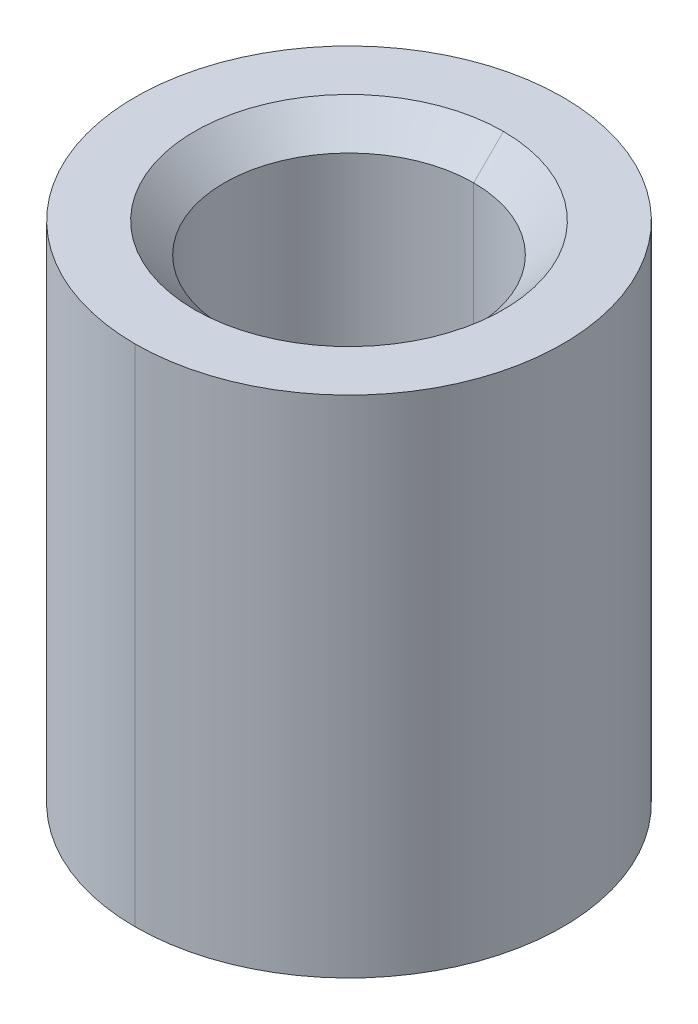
ISO-10303-21;
HEADER;
FILE_DESCRIPTION(('STEP AP214'),'2;1');
FILE_NAME('part.step','',(''),(''),'','','');
FILE_SCHEMA(('AUTOMOTIVE_DESIGN { 1 0 10303 214 1 1 1 1 }'));
ENDSEC;
DATA;
#1=APPLICATION_CONTEXT('core data for automotive mechanical design processes');
#2=APPLICATION_PROTOCOL_DEFINITION('international standard','automotive_design',2000,#1);
#3=PRODUCT_CONTEXT('',#1,'mechanical');
#4=PRODUCT('Part','Part','',(#3));
#5=PRODUCT_RELATED_PRODUCT_CATEGORY('part','',(#4));
#6=PRODUCT_DEFINITION_FORMATION('','',#4);
#7=PRODUCT_DEFINITION_CONTEXT('part definition',#1,'design');
#8=PRODUCT_DEFINITION('design','',#6,#7);
#9=PRODUCT_DEFINITION_SHAPE('','',#8);
#10=(LENGTH_UNIT() NAMED_UNIT(*) SI_UNIT(.MILLI.,.METRE.));
#11=(NAMED_UNIT(*) PLANE_ANGLE_UNIT() SI_UNIT($,.RADIAN.));
#12=(NAMED_UNIT(*) SI_UNIT($,.STERADIAN.) SOLID_ANGLE_UNIT());
#13=UNCERTAINTY_MEASURE_WITH_UNIT(LENGTH_MEASURE(1.E-05),#10,'distance_accuracy_value','');
#14=(GEOMETRIC_REPRESENTATION_CONTEXT(3) GLOBAL_UNCERTAINTY_ASSIGNED_CONTEXT((#13)) GLOBAL_UNIT_ASSIGNED_CONTEXT((#10,
#11,#12)) REPRESENTATION_CONTEXT('',''));
#15=CARTESIAN_POINT('',(0.,0.,0.));
#16=DIRECTION('',(0.,0.,1.));
#17=DIRECTION('',(1.,0.,0.));
#18=AXIS2_PLACEMENT_3D('',#15,#16,#17);
#19=CARTESIAN_POINT('',(-45.,9.7,-73.8));
#20=DIRECTION('',(0.,1.,0.));
#21=DIRECTION('',(0.,0.,-1.));
#22=AXIS2_PLACEMENT_3D('',#19,#20,#21);
#23=CONICAL_SURFACE('',#22,2.6,0.785398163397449);
#24=DIRECTION('',(0.,0.707106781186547,0.707106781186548));
#25=VECTOR('',#24,1.);
#26=CARTESIAN_POINT('',(-45.,9.7,-71.2));
#27=LINE('',#26,#25);
#28=CARTESIAN_POINT('',(-45.,9.2,-71.7));
#29=VERTEX_POINT('',#28);
#30=CARTESIAN_POINT('',(-45.,9.7,-71.2));
#31=VERTEX_POINT('',#30);
#32=EDGE_CURVE('E99',#29,#31,#27,.T.);
#33=ORIENTED_EDGE('',*,*,#32,.F.);
#34=CARTESIAN_POINT('',(-45.,9.2,-73.8));
#35=DIRECTION('',(0.,1.,0.));
#36=DIRECTION('',(0.,0.,-1.));
#37=AXIS2_PLACEMENT_3D('',#34,#35,#36);
#38=CIRCLE('',#37,2.1);
#39=CARTESIAN_POINT('',(-45.,9.2,-75.9));
#40=VERTEX_POINT('',#39);
#41=EDGE_CURVE('E11',#40,#29,#38,.T.);
#42=ORIENTED_EDGE('',*,*,#41,.F.);
#43=DIRECTION('',(0.,0.707106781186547,-0.707106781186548));
#44=VECTOR('',#43,1.);
#45=CARTESIAN_POINT('',(-45.,9.7,-76.4));
#46=LINE('',#45,#44);
#47=CARTESIAN_POINT('',(-45.,9.7,-76.4));
#48=VERTEX_POINT('',#47);
#49=EDGE_CURVE('E108',#40,#48,#46,.T.);
#50=ORIENTED_EDGE('',*,*,#49,.T.);
#51=CARTESIAN_POINT('',(-45.,9.7,-73.8));
#52=DIRECTION('',(0.,1.,0.));
#53=DIRECTION('',(0.,0.,-1.));
#54=AXIS2_PLACEMENT_3D('',#51,#52,#53);
#55=CIRCLE('',#54,2.6);
#56=EDGE_CURVE('E100',#48,#31,#55,.T.);
#57=ORIENTED_EDGE('',*,*,#56,.T.);
#58=EDGE_LOOP('',(#33,#42,#50,#57));
#59=FACE_BOUND('',#58,.T.);
#60=ADVANCED_FACE('F16',(#59),#23,.F.);
#61=CARTESIAN_POINT('',(-45.,9.7,-73.8));
#62=DIRECTION('',(0.,1.,0.));
#63=DIRECTION('',(0.,0.,-1.));
#64=AXIS2_PLACEMENT_3D('',#61,#62,#63);
#65=CYLINDRICAL_SURFACE('',#64,2.1);
#66=DIRECTION('',(0.,1.,0.));
#67=VECTOR('',#66,1.);
#68=CARTESIAN_POINT('',(-45.,9.7,-71.7));
#69=LINE('',#68,#67);
#70=CARTESIAN_POINT('',(-45.,2.2,-71.7));
#71=VERTEX_POINT('',#70);
#72=EDGE_CURVE('E81',#71,#29,#69,.T.);
#73=ORIENTED_EDGE('',*,*,#72,.F.);
#74=CARTESIAN_POINT('',(-45.,2.2,-73.8));
#75=DIRECTION('',(0.,1.,0.));
#76=DIRECTION('',(0.,0.,-1.));
#77=AXIS2_PLACEMENT_3D('',#74,#75,#76);
#78=CIRCLE('',#77,2.1);
#79=CARTESIAN_POINT('',(-45.,2.2,-75.9));
#80=VERTEX_POINT('',#79);
#81=EDGE_CURVE('E25',#80,#71,#78,.T.);
#82=ORIENTED_EDGE('',*,*,#81,.F.);
#83=DIRECTION('',(0.,1.,0.));
#84=VECTOR('',#83,1.);
#85=CARTESIAN_POINT('',(-45.,9.7,-75.9));
#86=LINE('',#85,#84);
#87=EDGE_CURVE('E84',#80,#40,#86,.T.);
#88=ORIENTED_EDGE('',*,*,#87,.T.);
#89=ORIENTED_EDGE('',*,*,#41,.T.);
#90=EDGE_LOOP('',(#73,#82,#88,#89));
#91=FACE_BOUND('',#90,.T.);
#92=ADVANCED_FACE('F80',(#91),#65,.F.);
#93=CARTESIAN_POINT('',(-45.,2.2,-73.8));
#94=DIRECTION('',(0.,1.,0.));
#95=DIRECTION('',(0.,0.,-1.));
#96=AXIS2_PLACEMENT_3D('',#93,#94,#95);
#97=CONICAL_SURFACE('',#96,2.1,1.32644576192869);
#98=DIRECTION('',(0.,0.241926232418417,0.970294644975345));
#99=VECTOR('',#98,1.);
#100=CARTESIAN_POINT('',(-45.,2.2,-71.7));
#101=LINE('',#100,#99);
#102=CARTESIAN_POINT('',(-45.,1.67640122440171,-73.8));
#103=VERTEX_POINT('',#102);
#104=EDGE_CURVE('E121',#103,#71,#101,.T.);
#105=ORIENTED_EDGE('',*,*,#104,.F.);
#106=DIRECTION('',(0.,0.241926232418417,-0.970294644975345));
#107=VECTOR('',#106,1.);
#108=CARTESIAN_POINT('',(-45.,2.2,-75.9));
#109=LINE('',#108,#107);
#110=EDGE_CURVE('E134',#103,#80,#109,.T.);
#111=ORIENTED_EDGE('',*,*,#110,.T.);
#112=ORIENTED_EDGE('',*,*,#81,.T.);
#113=EDGE_LOOP('',(#105,#111,#112));
#114=FACE_BOUND('',#113,.T.);
#115=ADVANCED_FACE('F152',(#114),#97,.F.);
#116=CARTESIAN_POINT('',(-45.,9.7,-73.8));
#117=DIRECTION('',(0.,-1.,0.));
#118=DIRECTION('',(-1.,0.,0.));
#119=AXIS2_PLACEMENT_3D('',#116,#117,#118);
#120=PLANE('',#119);
#121=ORIENTED_EDGE('',*,*,#56,.F.);
#122=CARTESIAN_POINT('',(-45.,9.7,-73.8));
#123=DIRECTION('',(0.,1.,0.));
#124=DIRECTION('',(0.,0.,-1.));
#125=AXIS2_PLACEMENT_3D('',#122,#123,#124);
#126=CIRCLE('',#125,2.6);
#127=EDGE_CURVE('E105',#31,#48,#126,.T.);
#128=ORIENTED_EDGE('',*,*,#127,.F.);
#129=EDGE_LOOP('',(#121,#128));
#130=FACE_BOUND('',#129,.T.);
#131=CARTESIAN_POINT('',(-45.,9.7,-73.8));
#132=DIRECTION('',(0.,1.,0.));
#133=DIRECTION('',(0.,0.,-1.));
#134=AXIS2_PLACEMENT_3D('',#131,#132,#133);
#135=CIRCLE('',#134,3.6);
#136=CARTESIAN_POINT('',(-45.,9.7,-77.4));
#137=VERTEX_POINT('',#136);
#138=CARTESIAN_POINT('',(-45.,9.7,-70.2));
#139=VERTEX_POINT('',#138);
#140=EDGE_CURVE('E114',#137,#139,#135,.T.);
#141=ORIENTED_EDGE('',*,*,#140,.T.);
#142=CARTESIAN_POINT('',(-45.,9.7,-73.8));
#143=DIRECTION('',(0.,1.,0.));
#144=DIRECTION('',(0.,0.,-1.));
#145=AXIS2_PLACEMENT_3D('',#142,#143,#144);
#146=CIRCLE('',#145,3.6);
#147=EDGE_CURVE('E35',#139,#137,#146,.T.);
#148=ORIENTED_EDGE('',*,*,#147,.T.);
#149=EDGE_LOOP('',(#141,#148));
#150=FACE_BOUND('',#149,.T.);
#151=ADVANCED_FACE('F18',(#130,#150),#120,.F.);
#152=CARTESIAN_POINT('',(-48.6,1.2,-73.8));
#153=DIRECTION('',(0.,1.,0.));
#154=DIRECTION('',(0.,0.,-1.));
#155=AXIS2_PLACEMENT_3D('',#152,#153,#154);
#156=PLANE('',#155);
#157=CARTESIAN_POINT('',(-45.,1.2,-73.8));
#158=DIRECTION('',(0.,1.,0.));
#159=DIRECTION('',(0.,0.,-1.));
#160=AXIS2_PLACEMENT_3D('',#157,#158,#159);
#161=CIRCLE('',#160,3.6);
#162=CARTESIAN_POINT('',(-45.,1.2,-77.4));
#163=VERTEX_POINT('',#162);
#164=CARTESIAN_POINT('',(-45.,1.2,-70.2));
#165=VERTEX_POINT('',#164);
#166=EDGE_CURVE('E116',#163,#165,#161,.T.);
#167=ORIENTED_EDGE('',*,*,#166,.F.);
#168=CARTESIAN_POINT('',(-45.,1.2,-73.8));
#169=DIRECTION('',(0.,1.,0.));
#170=DIRECTION('',(0.,0.,-1.));
#171=AXIS2_PLACEMENT_3D('',#168,#169,#170);
#172=CIRCLE('',#171,3.6);
#173=EDGE_CURVE('E128',#165,#163,#172,.T.);
#174=ORIENTED_EDGE('',*,*,#173,.F.);
#175=EDGE_LOOP('',(#167,#174));
#176=FACE_BOUND('',#175,.T.);
#177=ADVANCED_FACE('F175',(#176),#156,.F.);
#178=CARTESIAN_POINT('',(-45.,9.7,-73.8));
#179=DIRECTION('',(0.,1.,0.));
#180=DIRECTION('',(0.,0.,-1.));
#181=AXIS2_PLACEMENT_3D('',#178,#179,#180);
#182=CYLINDRICAL_SURFACE('',#181,3.6);
#183=DIRECTION('',(0.,1.,0.));
#184=VECTOR('',#183,1.);
#185=CARTESIAN_POINT('',(-45.,9.7,-70.2));
#186=LINE('',#185,#184);
#187=EDGE_CURVE('E120',#165,#139,#186,.T.);
#188=ORIENTED_EDGE('',*,*,#187,.F.);
#189=ORIENTED_EDGE('',*,*,#173,.T.);
#190=DIRECTION('',(0.,1.,0.));
#191=VECTOR('',#190,1.);
#192=CARTESIAN_POINT('',(-45.,9.7,-77.4));
#193=LINE('',#192,#191);
#194=EDGE_CURVE('E131',#163,#137,#193,.T.);
#195=ORIENTED_EDGE('',*,*,#194,.T.);
#196=ORIENTED_EDGE('',*,*,#147,.F.);
#197=EDGE_LOOP('',(#188,#189,#195,#196));
#198=FACE_BOUND('',#197,.T.);
#199=ADVANCED_FACE('F165',(#198),#182,.T.);
#200=CARTESIAN_POINT('',(-45.,9.7,-73.8));
#201=DIRECTION('',(0.,1.,0.));
#202=DIRECTION('',(0.,0.,-1.));
#203=AXIS2_PLACEMENT_3D('',#200,#201,#202);
#204=CYLINDRICAL_SURFACE('',#203,3.6);
#205=ORIENTED_EDGE('',*,*,#166,.T.);
#206=ORIENTED_EDGE('',*,*,#187,.T.);
#207=ORIENTED_EDGE('',*,*,#140,.F.);
#208=ORIENTED_EDGE('',*,*,#194,.F.);
#209=EDGE_LOOP('',(#205,#206,#207,#208));
#210=FACE_BOUND('',#209,.T.);
#211=ADVANCED_FACE('F157',(#210),#204,.T.);
#212=CARTESIAN_POINT('',(-45.,2.2,-73.8));
#213=DIRECTION('',(0.,1.,0.));
#214=DIRECTION('',(0.,0.,-1.));
#215=AXIS2_PLACEMENT_3D('',#212,#213,#214);
#216=CONICAL_SURFACE('',#215,2.1,1.32644576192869);
#217=ORIENTED_EDGE('',*,*,#110,.F.);
#218=ORIENTED_EDGE('',*,*,#104,.T.);
#219=CARTESIAN_POINT('',(-45.,2.2,-73.8));
#220=DIRECTION('',(0.,1.,0.));
#221=DIRECTION('',(0.,0.,-1.));
#222=AXIS2_PLACEMENT_3D('',#219,#220,#221);
#223=CIRCLE('',#222,2.1);
#224=EDGE_CURVE('E95',#71,#80,#223,.T.);
#225=ORIENTED_EDGE('',*,*,#224,.T.);
#226=EDGE_LOOP('',(#217,#218,#225));
#227=FACE_BOUND('',#226,.T.);
#228=ADVANCED_FACE('F155',(#227),#216,.F.);
#229=CARTESIAN_POINT('',(-45.,9.7,-73.8));
#230=DIRECTION('',(0.,1.,0.));
#231=DIRECTION('',(0.,0.,-1.));
#232=AXIS2_PLACEMENT_3D('',#229,#230,#231);
#233=CYLINDRICAL_SURFACE('',#232,2.1);
#234=ORIENTED_EDGE('',*,*,#224,.F.);
#235=ORIENTED_EDGE('',*,*,#72,.T.);
#236=CARTESIAN_POINT('',(-45.,9.2,-73.8));
#237=DIRECTION('',(0.,1.,0.));
#238=DIRECTION('',(0.,0.,-1.));
#239=AXIS2_PLACEMENT_3D('',#236,#237,#238);
#240=CIRCLE('',#239,2.1);
#241=EDGE_CURVE('E93',#29,#40,#240,.T.);
#242=ORIENTED_EDGE('',*,*,#241,.T.);
#243=ORIENTED_EDGE('',*,*,#87,.F.);
#244=EDGE_LOOP('',(#234,#235,#242,#243));
#245=FACE_BOUND('',#244,.T.);
#246=ADVANCED_FACE('F91',(#245),#233,.F.);
#247=CARTESIAN_POINT('',(-45.,9.7,-73.8));
#248=DIRECTION('',(0.,1.,0.));
#249=DIRECTION('',(0.,0.,-1.));
#250=AXIS2_PLACEMENT_3D('',#247,#248,#249);
#251=CONICAL_SURFACE('',#250,2.6,0.785398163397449);
#252=ORIENTED_EDGE('',*,*,#241,.F.);
#253=ORIENTED_EDGE('',*,*,#32,.T.);
#254=ORIENTED_EDGE('',*,*,#127,.T.);
#255=ORIENTED_EDGE('',*,*,#49,.F.);
#256=EDGE_LOOP('',(#252,#253,#254,#255));
#257=FACE_BOUND('',#256,.T.);
#258=ADVANCED_FACE('F107',(#257),#251,.F.);
#259=CLOSED_SHELL('',(#60,#92,#115,#151,#177,#199,#211,#228,#246,#258));
#260=MANIFOLD_SOLID_BREP('B1',#259);
#261=ADVANCED_BREP_SHAPE_REPRESENTATION('',(#18,#260),#14);
#262=SHAPE_DEFINITION_REPRESENTATION(#9,#261);
ENDSEC;
END-ISO-10303-21;
